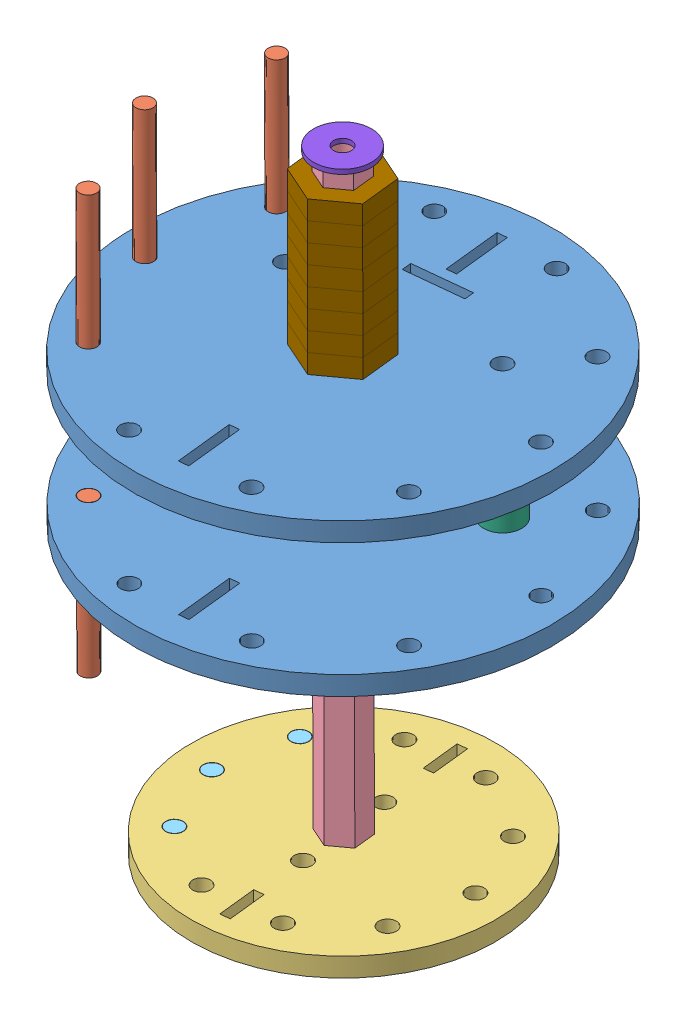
SolidWorks assembly Accumulator.SLDASM, configuration Default (file format 7000). Lengths in mm.
Overall size (76.79 111.93 76.84).
26 component instances, 9 part files, 36 mates.
Components (placement in the parent):
- AccumulatorGear-3: AccumulatorGear.SLDPRT [accum] at (5.3261 -33.8708 28.4877) x (0.104553 -0.002805 0.994515) z (-0.994519 0.00053 0.104555) size (69.85 3.17 69.85)
- AccumulatorGear-4: AccumulatorGear.SLDPRT [accum] at (5.3078 -56.0957 28.4269) x (0.104553 -0.002805 0.994515) z (-0.994519 0.00053 0.104555) size (69.85 3.17 69.85)
- Screw-4-40-1in-1: Screw-4-40-1in.SLDPRT [Default] at (-24.534 -8.455 31.6985) x (0.998773 -0.000684 -0.049509) z (-0.049507 0.002771 -0.99877) size (2.84 25.4 2.84)
- Screw-4-40-1in-2: Screw-4-40-1in.SLDPRT [Default] at (-20.6737 -8.4085 13.5351) x (0.998773 -0.000684 -0.049509) z (-0.049507 0.002771 -0.99877) size (2.84 25.4 2.84)
- Screw-4-40-1in-3: Screw-4-40-1in.SLDPRT [Default] at (-16.9808 -8.5076 48.662) x (0.998773 -0.000684 -0.049509) z (-0.049507 0.002771 -0.99877) size (2.84 25.4 2.84)
- Screw-4-40-1in-4: Screw-4-40-1in.SLDPRT [Default] at (-24.5704 -52.9048 31.577) x (0.998773 -0.000684 -0.049509) z (-0.049507 0.002771 -0.99877) size (2.84 25.4 2.84)
- Screw-4-40-1in-5: Screw-4-40-1in.SLDPRT [Default] at (-17.0381 -78.3573 48.4711) x (-0.902967 0.001916 -0.429705) z (0.429708 0.002116 -0.902965) size (2.84 25.4 2.84)
- Screw-4-40-1in-6: Screw-4-40-1in.SLDPRT [Default] at (-20.7101 -52.8583 13.4136) x (0.998773 -0.000684 -0.049509) z (-0.049507 0.002771 -0.99877) size (2.84 25.4 2.84)
- OutputGear-1: OutputGear.SLDPRT [Default] at (5.2689 -103.5935 28.297) x (0.104553 -0.002805 0.994515) z (-0.994519 0.00053 0.104555) size (50.8 3.17 50.8)
- Standoff-4in-1s4-2: Standoff-4in-1s4.SLDPRT [Default] at (5.2689 -103.5935 28.297) x (0.104553 -0.002805 0.994515) z (-0.994519 0.00053 0.104555) size (7.33 101.6 6.35)
- Screw-4-40-0p5in-1: Screw-4-40-0p5in.SLDPRT [Default] at (-14.6072 -113.1079 30.3598) x (1 -0.00082 -0.000001) z (-0.000001 -0.002734 0.999996) size (2.84 12.7 2.84)
- Screw-4-40-0p5in-2: Screw-4-40-0p5in.SLDPRT [Default] at (-9.585 -113.1428 41.6391) x (1 -0.00082 -0.000001) z (-0.000001 -0.002734 0.999996) size (2.84 12.7 2.84)
- Screw-4-40-0p5in-3: Screw-4-40-0p5in.SLDPRT [Default] at (-12.0405 -113.077 18.2826) x (1 -0.00082 -0.000001) z (-0.000001 -0.002734 0.999996) size (2.84 12.7 2.84)
- Standoff-p75in-1s4-1: Standoff-p75in-1s4.SLDPRT [Default] at (20.7376 -33.8528 17.29) x (1 -0.00082 -0.000001) z (-0.00082 -0.999996 -0.002734) size (6.35 6.35 19.05)
- Standoff-p75in-1s4-2: Standoff-p75in-1s4.SLDPRT [Default] at (-12.0772 -33.8353 20.7398) x (0.984615 -0.00033 -0.174737) z (-0.00082 -0.999996 -0.002734) size (6.35 6.35 19.05)
- OutputGearCap-1: OutputGearCap.SLDPRT [Default] at (5.2663 -106.7685 28.2884) x (0.104553 -0.002805 0.994515) z (-0.994519 0.00053 0.104555) size (21.59 3.17 21.59)
- Washer-0p38in-1: Washer-0p38in.SLDPRT [Default] at (5.3522 -1.9939 28.5748) x (0.863042 0.000673 -0.505132) z (0.00082 0.999996 0.002734) size (9.65 9.65 0.76)
- Spacer-stack-8-1: Spacer-stack-8.SLDASM [Default] at (-3.9241 -38.1647 21.5198) x (0.104553 -0.002805 0.994515) z (0.00082 0.999996 0.002734) size (13.2 11.43 25.4)
  - Spacer-hex-1s4-1: Spacer-hex-1s4.SLDPRT [Default] at (7.8847 8.4687 7.4956) size (13.2 11.43 3.17)
  - Spacer-hex-1s4-2: Spacer-hex-1s4.SLDPRT [Default] at (7.8847 8.4687 10.6706) size (13.2 11.43 3.17)
  - Spacer-hex-1s4-3: Spacer-hex-1s4.SLDPRT [Default] at (7.8847 8.4687 13.8456) size (13.2 11.43 3.17)
  - Spacer-hex-1s4-4: Spacer-hex-1s4.SLDPRT [Default] at (7.8847 8.4687 17.0206) size (13.2 11.43 3.17)
  - Spacer-hex-1s4-5: Spacer-hex-1s4.SLDPRT [Default] at (7.8847 8.4687 20.1956) size (13.2 11.43 3.17)
  - Spacer-hex-1s4-6: Spacer-hex-1s4.SLDPRT [Default] at (7.8847 8.4687 23.3706) size (13.2 11.43 3.17)
  - Spacer-hex-1s4-7: Spacer-hex-1s4.SLDPRT [Default] at (7.8847 8.4687 26.5456) size (13.2 11.43 3.17)
  - Spacer-hex-1s4-8: Spacer-hex-1s4.SLDPRT [Default] at (7.8847 8.4687 29.7206) size (13.2 11.43 3.17)
Mates (geometry in assembly coordinates):
- Concentric16: concentric anti-aligned: circle of AccumulatorGear-3; circle of Screw-4-40-1in-1
- Coincident36: coincident aligned: plane of AccumulatorGear-3 through (5.3261 -33.8708 28.4877) normal (-0.00082 -0.999996 -0.002734); plane of Screw-4-40-1in-1 through (-24.5548 -33.8549 31.6291) normal (-0.00082 -0.999996 -0.002734)
- Concentric17: concentric anti-aligned: circle of AccumulatorGear-3; circle of Screw-4-40-1in-2
- Coincident37: coincident aligned: plane of AccumulatorGear-3 through (5.3261 -33.8708 28.4877) normal (-0.00082 -0.999996 -0.002734); plane of Screw-4-40-1in-2 through (-20.6945 -33.8084 13.4657) normal (-0.00082 -0.999996 -0.002734)
- Concentric18: concentric anti-aligned: circle of AccumulatorGear-3; circle of Screw-4-40-1in-3
- Coincident38: coincident aligned: plane of AccumulatorGear-3 through (5.3261 -33.8708 28.4877) normal (-0.00082 -0.999996 -0.002734); plane of Screw-4-40-1in-3 through (-17.0016 -33.9074 48.5926) normal (-0.00082 -0.999996 -0.002734)
- Concentric19: concentric anti-aligned: circle of AccumulatorGear-4; circle of Screw-4-40-1in-4
- Coincident43: coincident aligned: plane of AccumulatorGear-4 through (5.3104 -52.9207 28.4356) normal (0.00082 0.999996 0.002734); plane of Screw-4-40-1in-4 through (-24.5704 -52.9048 31.577) normal (0.00082 0.999996 0.002734)
- Concentric20: concentric aligned: circle of AccumulatorGear-4; circle of Screw-4-40-1in-5
- Coincident44: coincident aligned: plane of AccumulatorGear-4 through (5.3104 -52.9207 28.4356) normal (0.00082 0.999996 0.002734); plane of Screw-4-40-1in-5 through (-17.0172 -52.9574 48.5405) normal (0.00082 0.999996 0.002734)
- Concentric21: concentric anti-aligned: circle of AccumulatorGear-4; circle of Screw-4-40-1in-6
- Coincident45: coincident aligned: plane of AccumulatorGear-4 through (5.3104 -52.9207 28.4356) normal (0.00082 0.999996 0.002734); plane of Screw-4-40-1in-6 through (-20.7101 -52.8583 13.4136) normal (0.00082 0.999996 0.002734)
- Coincident55: coincident aligned: line of OutputGear-1 through (5.6522 -103.6038 31.9431) axis (0.809002 0.000943 -0.587805); line of Standoff-4in-1s4-2 through (5.6522 -103.6038 31.9431) axis (0.809002 0.000943 -0.587805)
- Coincident56: coincident aligned: line of OutputGear-1 through (8.6181 -103.6003 29.7881) axis (-0.104553 0.002805 -0.994515); line of Standoff-4in-1s4-2 through (8.6181 -103.6003 29.7881) axis (-0.104553 0.002805 -0.994515)
- Concentric22: concentric aligned: circle of OutputGear-1; circle of Screw-4-40-0p5in-1
- Coincident57: coincident aligned: plane of OutputGear-1 through (5.2715 -100.4185 28.3057) normal (0.00082 0.999996 0.002734); plane of Screw-4-40-0p5in-1 through (-14.5968 -100.4079 30.3945) normal (0.00082 0.999996 0.002734)
- Concentric23: concentric aligned: circle of OutputGear-1; circle of Screw-4-40-0p5in-2
- Coincident58: coincident aligned: plane of OutputGear-1 through (5.2715 -100.4185 28.3057) normal (0.00082 0.999996 0.002734); plane of Screw-4-40-0p5in-2 through (-9.5746 -100.4429 41.6738) normal (0.00082 0.999996 0.002734)
- Concentric24: concentric aligned: circle of OutputGear-1; circle of Screw-4-40-0p5in-3
- Coincident59: coincident aligned: plane of OutputGear-1 through (5.2715 -100.4185 28.3057) normal (0.00082 0.999996 0.002734); circle of Screw-4-40-0p5in-3
- Coincident60: coincident anti-aligned: plane of AccumulatorGear-4 through (5.6937 -52.931 32.0817) normal (-0.587805 0.002694 -0.808998); plane of Standoff-4in-1s4-2 through (5.7355 -2.0042 32.2209) normal (0.587805 -0.002694 0.808998)
- Coincident61: coincident anti-aligned: plane of AccumulatorGear-4 through (2.3445 -52.9242 30.5906) normal (0.406714 0.002164 -0.913553); plane of Standoff-4in-1s4-2 through (2.3863 -1.9974 30.7298) normal (-0.406714 -0.002164 0.913553)
- Coincident62: coincident anti-aligned: plane of AccumulatorGear-3 through (4.9454 -30.6855 24.8503) normal (0.587805 -0.002694 0.808998); plane of Standoff-4in-1s4-2 through (4.9689 -1.9836 24.9288) normal (-0.587805 0.002694 -0.808998)
- Coincident63: coincident anti-aligned: plane of AccumulatorGear-3 through (8.2946 -30.6924 26.3414) normal (-0.406714 -0.002164 0.913553); plane of Standoff-4in-1s4-2 through (8.3182 -1.9905 26.4198) normal (0.406714 0.002164 -0.913553)
- Coincident67: coincident anti-aligned: plane of AccumulatorGear-3 through (5.3261 -33.8708 28.4877) normal (-0.00082 -0.999996 -0.002734); plane of Standoff-p75in-1s4-2 through (-12.0772 -33.8353 20.7398) normal (0.00082 0.999996 0.002734)
- Concentric25: concentric aligned: circle of Standoff-4in-1s4-2; circle of OutputGearCap-1
- Coincident68: coincident aligned: circle of OutputGear-1; circle of OutputGearCap-1
- Coincident69: coincident anti-aligned: circle of AccumulatorGear-3; circle of Standoff-p75in-1s4-2
- Coincident70: coincident anti-aligned: circle of AccumulatorGear-3; circle of Standoff-p75in-1s4-1
- Concentric26: concentric aligned: circle of Standoff-4in-1s4-2; circle of Washer-0p38in-1
- Coincident71: coincident anti-aligned: plane of Standoff-4in-1s4-2 through (5.3522 -1.9939 28.5748) normal (0.00082 0.999996 0.002734); plane of Washer-0p38in-1 through (5.3522 -1.9939 28.5748) normal (-0.00082 -0.999996 -0.002734)
- Coincident84: coincident anti-aligned: plane of Standoff-4in-1s4-2 through (4.9689 -1.9836 24.9288) normal (-0.587805 0.002694 -0.808998); plane of Spacer-stack-8-1/Spacer-hex-1s4-1 through (4.948 -27.5105 24.859) normal (0.587805 -0.002694 0.808998)
- Coincident85: coincident anti-aligned: plane of Standoff-4in-1s4-2 through (8.3182 -1.9905 26.4198) normal (0.406714 0.002164 -0.913553); plane of Spacer-stack-8-1/Spacer-hex-1s4-1 through (8.2972 -27.5174 26.35) normal (-0.406714 -0.002164 0.913553)
- Coincident87: coincident anti-aligned: plane of AccumulatorGear-4 through (5.3104 -52.9207 28.4356) normal (0.00082 0.999996 0.002734); plane of Standoff-p75in-1s4-2 through (-12.0928 -52.8853 20.6878) normal (-0.00082 -0.999996 -0.002734)
- Coincident89: coincident anti-aligned: plane of AccumulatorGear-3 through (5.3287 -30.6958 28.4964) normal (0.00082 0.999996 0.002734); plane of Spacer-stack-8-1/Spacer-hex-1s4-1 through (5.3287 -30.6958 28.4964) normal (-0.00082 -0.999996 -0.002734)
- Distance1: distance = 3.302 mm anti-aligned: plane of Washer-0p38in-1 through (5.3522 -1.9939 28.5748) normal (-0.00082 -0.999996 -0.002734); plane of Spacer-stack-8-1/Spacer-hex-1s4-8 through (5.3495 -5.2959 28.5658) normal (0.00082 0.999996 0.002734)
